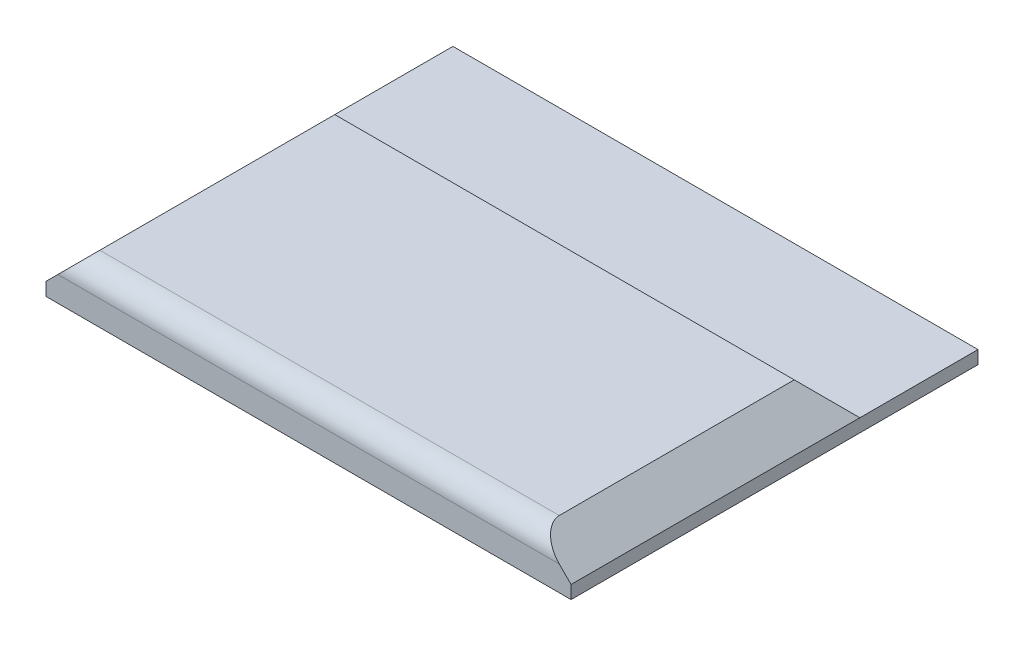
ISO-10303-21;
HEADER;
FILE_DESCRIPTION(('STEP AP214'),'2;1');
FILE_NAME('part.step','',(''),(''),'','','');
FILE_SCHEMA(('AUTOMOTIVE_DESIGN { 1 0 10303 214 1 1 1 1 }'));
ENDSEC;
DATA;
#1=APPLICATION_CONTEXT('core data for automotive mechanical design processes');
#2=APPLICATION_PROTOCOL_DEFINITION('international standard','automotive_design',2000,#1);
#3=PRODUCT_CONTEXT('',#1,'mechanical');
#4=PRODUCT('Part','Part','',(#3));
#5=PRODUCT_RELATED_PRODUCT_CATEGORY('part','',(#4));
#6=PRODUCT_DEFINITION_FORMATION('','',#4);
#7=PRODUCT_DEFINITION_CONTEXT('part definition',#1,'design');
#8=PRODUCT_DEFINITION('design','',#6,#7);
#9=PRODUCT_DEFINITION_SHAPE('','',#8);
#10=(LENGTH_UNIT() NAMED_UNIT(*) SI_UNIT(.MILLI.,.METRE.));
#11=(NAMED_UNIT(*) PLANE_ANGLE_UNIT() SI_UNIT($,.RADIAN.));
#12=(NAMED_UNIT(*) SI_UNIT($,.STERADIAN.) SOLID_ANGLE_UNIT());
#13=UNCERTAINTY_MEASURE_WITH_UNIT(LENGTH_MEASURE(1.E-05),#10,'distance_accuracy_value','');
#14=(GEOMETRIC_REPRESENTATION_CONTEXT(3) GLOBAL_UNCERTAINTY_ASSIGNED_CONTEXT((#13)) GLOBAL_UNIT_ASSIGNED_CONTEXT((#10,
#11,#12)) REPRESENTATION_CONTEXT('',''));
#15=CARTESIAN_POINT('',(0.,0.,0.));
#16=DIRECTION('',(0.,0.,1.));
#17=DIRECTION('',(1.,0.,0.));
#18=AXIS2_PLACEMENT_3D('',#15,#16,#17);
#19=CARTESIAN_POINT('',(63.5,3.96875,-34.925));
#20=DIRECTION('',(0.,1.,0.));
#21=DIRECTION('',(0.,0.,1.));
#22=AXIS2_PLACEMENT_3D('',#19,#20,#21);
#23=PLANE('',#22);
#24=DIRECTION('',(1.,0.,0.));
#25=VECTOR('',#24,1.);
#26=CARTESIAN_POINT('',(63.5,3.96875,-24.209375));
#27=LINE('',#26,#25);
#28=CARTESIAN_POINT('',(16.271875,3.96875,-24.209375));
#29=VERTEX_POINT('',#28);
#30=CARTESIAN_POINT('',(47.228125,3.96875,-24.209375));
#31=VERTEX_POINT('',#30);
#32=EDGE_CURVE('E762',#29,#31,#27,.T.);
#33=ORIENTED_EDGE('',*,*,#32,.F.);
#34=DIRECTION('',(0.,0.,-1.));
#35=VECTOR('',#34,1.);
#36=CARTESIAN_POINT('',(16.271875,3.96875,-34.925));
#37=LINE('',#36,#35);
#38=CARTESIAN_POINT('',(16.271875,3.96875,-30.2986859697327));
#39=VERTEX_POINT('',#38);
#40=EDGE_CURVE('E470',#29,#39,#37,.T.);
#41=ORIENTED_EDGE('',*,*,#40,.T.);
#42=DIRECTION('',(-1.,0.,0.));
#43=VECTOR('',#42,1.);
#44=CARTESIAN_POINT('',(63.5,3.96875,-30.2986859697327));
#45=LINE('',#44,#43);
#46=CARTESIAN_POINT('',(47.228125,3.96875,-30.2986859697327));
#47=VERTEX_POINT('',#46);
#48=EDGE_CURVE('E518',#47,#39,#45,.T.);
#49=ORIENTED_EDGE('',*,*,#48,.F.);
#50=DIRECTION('',(0.,0.,-1.));
#51=VECTOR('',#50,1.);
#52=CARTESIAN_POINT('',(47.228125,3.96875,-34.925));
#53=LINE('',#52,#51);
#54=EDGE_CURVE('E439',#31,#47,#53,.T.);
#55=ORIENTED_EDGE('',*,*,#54,.F.);
#56=EDGE_LOOP('',(#33,#41,#49,#55));
#57=FACE_BOUND('',#56,.T.);
#58=ADVANCED_FACE('F31',(#57),#23,.F.);
#59=DIRECTION('',(1.,0.,0.));
#60=VECTOR('',#59,1.);
#61=CARTESIAN_POINT('',(63.5,3.96875,-24.209375));
#62=LINE('',#61,#60);
#63=CARTESIAN_POINT('',(4.6263140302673,3.96875,-24.209375));
#64=VERTEX_POINT('',#63);
#65=CARTESIAN_POINT('',(15.478125,3.96875,-24.209375));
#66=VERTEX_POINT('',#65);
#67=EDGE_CURVE('E54',#64,#66,#62,.T.);
#68=ORIENTED_EDGE('',*,*,#67,.F.);
#69=DIRECTION('',(0.,0.,1.));
#70=VECTOR('',#69,1.);
#71=CARTESIAN_POINT('',(4.6263140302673,3.96875,-34.925));
#72=LINE('',#71,#70);
#73=CARTESIAN_POINT('',(4.62631403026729,3.96875,-30.2986859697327));
#74=VERTEX_POINT('',#73);
#75=EDGE_CURVE('E526',#74,#64,#72,.T.);
#76=ORIENTED_EDGE('',*,*,#75,.F.);
#77=CARTESIAN_POINT('',(15.478125,3.96875,-30.2986859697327));
#78=VERTEX_POINT('',#77);
#79=EDGE_CURVE('E519',#78,#74,#45,.T.);
#80=ORIENTED_EDGE('',*,*,#79,.F.);
#81=DIRECTION('',(0.,0.,-1.));
#82=VECTOR('',#81,1.);
#83=CARTESIAN_POINT('',(15.478125,3.96875,-34.925));
#84=LINE('',#83,#82);
#85=EDGE_CURVE('E462',#66,#78,#84,.T.);
#86=ORIENTED_EDGE('',*,*,#85,.F.);
#87=EDGE_LOOP('',(#68,#76,#80,#86));
#88=FACE_BOUND('',#87,.T.);
#89=ADVANCED_FACE('F633',(#88),#23,.F.);
#90=CARTESIAN_POINT('',(1.5875,1.5875,0.));
#91=DIRECTION('',(1.,0.,0.));
#92=DIRECTION('',(0.,0.,-1.));
#93=AXIS2_PLACEMENT_3D('',#90,#91,#92);
#94=PLANE('',#93);
#95=DIRECTION('',(0.,0.,-1.));
#96=VECTOR('',#95,1.);
#97=CARTESIAN_POINT('',(1.5875,0.9299359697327,-34.925));
#98=LINE('',#97,#96);
#99=CARTESIAN_POINT('',(1.5875,0.9299359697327,-24.209375));
#100=VERTEX_POINT('',#99);
#101=CARTESIAN_POINT('',(1.5875,0.9299359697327,-33.3375));
#102=VERTEX_POINT('',#101);
#103=EDGE_CURVE('E492',#100,#102,#98,.T.);
#104=ORIENTED_EDGE('',*,*,#103,.F.);
#105=DIRECTION('',(0.,1.,0.));
#106=VECTOR('',#105,1.);
#107=CARTESIAN_POINT('',(1.5875,0.,-24.209375));
#108=LINE('',#107,#106);
#109=CARTESIAN_POINT('',(1.5875,0.,-24.209375));
#110=VERTEX_POINT('',#109);
#111=EDGE_CURVE('E386',#110,#100,#108,.T.);
#112=ORIENTED_EDGE('',*,*,#111,.F.);
#113=DIRECTION('',(0.,0.,1.));
#114=VECTOR('',#113,1.);
#115=CARTESIAN_POINT('',(1.5875,0.,-49.2125));
#116=LINE('',#115,#114);
#117=CARTESIAN_POINT('',(1.5875,0.,-34.2674359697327));
#118=VERTEX_POINT('',#117);
#119=EDGE_CURVE('E374',#118,#110,#116,.T.);
#120=ORIENTED_EDGE('',*,*,#119,.F.);
#121=DIRECTION('',(0.,0.707106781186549,0.707106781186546));
#122=VECTOR('',#121,1.);
#123=CARTESIAN_POINT('',(1.5875,17.9274679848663,-16.3399679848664));
#124=LINE('',#123,#122);
#125=EDGE_CURVE('E490',#118,#102,#124,.T.);
#126=ORIENTED_EDGE('',*,*,#125,.T.);
#127=EDGE_LOOP('',(#104,#112,#120,#126));
#128=FACE_BOUND('',#127,.T.);
#129=ADVANCED_FACE('F799',(#128),#94,.T.);
#130=CARTESIAN_POINT('',(61.9125,1.5875,0.));
#131=DIRECTION('',(-1.,0.,0.));
#132=DIRECTION('',(0.,0.,1.));
#133=AXIS2_PLACEMENT_3D('',#130,#131,#132);
#134=PLANE('',#133);
#135=DIRECTION('',(0.,0.,-1.));
#136=VECTOR('',#135,1.);
#137=CARTESIAN_POINT('',(61.9125,0.,-49.2125));
#138=LINE('',#137,#136);
#139=CARTESIAN_POINT('',(61.9125,0.,-24.209375));
#140=VERTEX_POINT('',#139);
#141=CARTESIAN_POINT('',(61.9125,0.,-34.2674359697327));
#142=VERTEX_POINT('',#141);
#143=EDGE_CURVE('E541',#140,#142,#138,.T.);
#144=ORIENTED_EDGE('',*,*,#143,.F.);
#145=DIRECTION('',(0.,1.,0.));
#146=VECTOR('',#145,1.);
#147=CARTESIAN_POINT('',(61.9125,0.,-24.209375));
#148=LINE('',#147,#146);
#149=CARTESIAN_POINT('',(61.9125,0.929935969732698,-24.209375));
#150=VERTEX_POINT('',#149);
#151=EDGE_CURVE('E391',#140,#150,#148,.T.);
#152=ORIENTED_EDGE('',*,*,#151,.T.);
#153=DIRECTION('',(0.,0.,1.));
#154=VECTOR('',#153,1.);
#155=CARTESIAN_POINT('',(61.9125,0.929935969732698,-34.925));
#156=LINE('',#155,#154);
#157=CARTESIAN_POINT('',(61.9125,0.929935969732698,-33.3375));
#158=VERTEX_POINT('',#157);
#159=EDGE_CURVE('E506',#158,#150,#156,.T.);
#160=ORIENTED_EDGE('',*,*,#159,.F.);
#161=DIRECTION('',(0.,0.707106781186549,0.707106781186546));
#162=VECTOR('',#161,1.);
#163=CARTESIAN_POINT('',(61.9125,4.43371798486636,-29.8337179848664));
#164=LINE('',#163,#162);
#165=EDGE_CURVE('E531',#142,#158,#164,.T.);
#166=ORIENTED_EDGE('',*,*,#165,.F.);
#167=EDGE_LOOP('',(#144,#152,#160,#166));
#168=FACE_BOUND('',#167,.T.);
#169=ADVANCED_FACE('F815',(#168),#134,.T.);
#170=DIRECTION('',(1.,0.,0.));
#171=VECTOR('',#170,1.);
#172=CARTESIAN_POINT('',(63.5,3.96875,-24.209375));
#173=LINE('',#172,#171);
#174=CARTESIAN_POINT('',(48.021875,3.96875,-24.209375));
#175=VERTEX_POINT('',#174);
#176=CARTESIAN_POINT('',(58.8736859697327,3.96875,-24.209375));
#177=VERTEX_POINT('',#176);
#178=EDGE_CURVE('E756',#175,#177,#173,.T.);
#179=ORIENTED_EDGE('',*,*,#178,.F.);
#180=DIRECTION('',(0.,0.,-1.));
#181=VECTOR('',#180,1.);
#182=CARTESIAN_POINT('',(48.021875,3.96875,-34.925));
#183=LINE('',#182,#181);
#184=CARTESIAN_POINT('',(48.021875,3.96875,-30.2986859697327));
#185=VERTEX_POINT('',#184);
#186=EDGE_CURVE('E448',#175,#185,#183,.T.);
#187=ORIENTED_EDGE('',*,*,#186,.T.);
#188=CARTESIAN_POINT('',(58.8736859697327,3.96875,-30.2986859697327));
#189=VERTEX_POINT('',#188);
#190=EDGE_CURVE('E514',#189,#185,#45,.T.);
#191=ORIENTED_EDGE('',*,*,#190,.F.);
#192=DIRECTION('',(0.,0.,-1.));
#193=VECTOR('',#192,1.);
#194=CARTESIAN_POINT('',(58.8736859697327,3.96875,-34.925));
#195=LINE('',#194,#193);
#196=EDGE_CURVE('E517',#177,#189,#195,.T.);
#197=ORIENTED_EDGE('',*,*,#196,.F.);
#198=EDGE_LOOP('',(#179,#187,#191,#197));
#199=FACE_BOUND('',#198,.T.);
#200=ADVANCED_FACE('F800',(#199),#23,.F.);
#201=CARTESIAN_POINT('',(5.09128201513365,4.43371798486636,-34.925));
#202=DIRECTION('',(-0.707106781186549,0.707106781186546,0.));
#203=DIRECTION('',(-0.707106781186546,-0.707106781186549,0.));
#204=AXIS2_PLACEMENT_3D('',#201,#202,#203);
#205=PLANE('',#204);
#206=DIRECTION('',(0.707106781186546,0.707106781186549,0.));
#207=VECTOR('',#206,1.);
#208=CARTESIAN_POINT('',(5.09128201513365,4.43371798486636,-24.209375));
#209=LINE('',#208,#207);
#210=EDGE_CURVE('E637',#100,#64,#209,.T.);
#211=ORIENTED_EDGE('',*,*,#210,.F.);
#212=ORIENTED_EDGE('',*,*,#103,.T.);
#213=DIRECTION('',(0.577350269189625,0.577350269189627,0.577350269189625));
#214=VECTOR('',#213,1.);
#215=CARTESIAN_POINT('',(24.5608546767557,23.9032906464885,-10.3641453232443));
#216=LINE('',#215,#214);
#217=EDGE_CURVE('E511',#102,#74,#216,.T.);
#218=ORIENTED_EDGE('',*,*,#217,.T.);
#219=ORIENTED_EDGE('',*,*,#75,.T.);
#220=EDGE_LOOP('',(#211,#212,#218,#219));
#221=FACE_BOUND('',#220,.T.);
#222=ADVANCED_FACE('F635',(#221),#205,.F.);
#223=CARTESIAN_POINT('',(58.4087179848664,4.43371798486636,-34.925));
#224=DIRECTION('',(0.707106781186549,0.707106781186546,0.));
#225=DIRECTION('',(-0.707106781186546,0.707106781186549,0.));
#226=AXIS2_PLACEMENT_3D('',#223,#224,#225);
#227=PLANE('',#226);
#228=DIRECTION('',(0.707106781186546,-0.707106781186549,0.));
#229=VECTOR('',#228,1.);
#230=CARTESIAN_POINT('',(58.4087179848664,4.43371798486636,-24.209375));
#231=LINE('',#230,#229);
#232=EDGE_CURVE('E368',#177,#150,#231,.T.);
#233=ORIENTED_EDGE('',*,*,#232,.F.);
#234=ORIENTED_EDGE('',*,*,#196,.T.);
#235=DIRECTION('',(-0.577350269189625,0.577350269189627,0.577350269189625));
#236=VECTOR('',#235,1.);
#237=CARTESIAN_POINT('',(60.1058119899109,2.73662397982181,-31.5308119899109));
#238=LINE('',#237,#236);
#239=EDGE_CURVE('E474',#158,#189,#238,.T.);
#240=ORIENTED_EDGE('',*,*,#239,.F.);
#241=ORIENTED_EDGE('',*,*,#159,.T.);
#242=EDGE_LOOP('',(#233,#234,#240,#241));
#243=FACE_BOUND('',#242,.T.);
#244=ADVANCED_FACE('F788',(#243),#227,.F.);
#245=CARTESIAN_POINT('',(16.271875,0.,-1.5875));
#246=DIRECTION('',(1.,0.,0.));
#247=DIRECTION('',(0.,0.,-1.));
#248=AXIS2_PLACEMENT_3D('',#245,#246,#247);
#249=PLANE('',#248);
#250=ORIENTED_EDGE('',*,*,#40,.F.);
#251=DIRECTION('',(0.,-1.,0.));
#252=VECTOR('',#251,1.);
#253=CARTESIAN_POINT('',(16.271875,0.,-24.209375));
#254=LINE('',#253,#252);
#255=CARTESIAN_POINT('',(16.271875,0.,-24.209375));
#256=VERTEX_POINT('',#255);
#257=EDGE_CURVE('E760',#29,#256,#254,.T.);
#258=ORIENTED_EDGE('',*,*,#257,.T.);
#259=DIRECTION('',(0.,0.,-1.));
#260=VECTOR('',#259,1.);
#261=CARTESIAN_POINT('',(16.271875,0.,-1.5875));
#262=LINE('',#261,#260);
#263=CARTESIAN_POINT('',(16.271875,0.,-34.2674359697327));
#264=VERTEX_POINT('',#263);
#265=EDGE_CURVE('E455',#256,#264,#262,.T.);
#266=ORIENTED_EDGE('',*,*,#265,.T.);
#267=DIRECTION('',(0.,-0.707106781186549,-0.707106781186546));
#268=VECTOR('',#267,1.);
#269=CARTESIAN_POINT('',(16.271875,4.43371798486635,-29.8337179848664));
#270=LINE('',#269,#268);
#271=EDGE_CURVE('E466',#39,#264,#270,.T.);
#272=ORIENTED_EDGE('',*,*,#271,.F.);
#273=EDGE_LOOP('',(#250,#258,#266,#272));
#274=FACE_BOUND('',#273,.T.);
#275=ADVANCED_FACE('F777',(#274),#249,.T.);
#276=CARTESIAN_POINT('',(15.478125,0.,-1.5875));
#277=DIRECTION('',(1.,0.,0.));
#278=DIRECTION('',(0.,0.,-1.));
#279=AXIS2_PLACEMENT_3D('',#276,#277,#278);
#280=PLANE('',#279);
#281=DIRECTION('',(0.,-1.,0.));
#282=VECTOR('',#281,1.);
#283=CARTESIAN_POINT('',(15.478125,0.,-24.209375));
#284=LINE('',#283,#282);
#285=CARTESIAN_POINT('',(15.478125,0.,-24.209375));
#286=VERTEX_POINT('',#285);
#287=EDGE_CURVE('E352',#66,#286,#284,.T.);
#288=ORIENTED_EDGE('',*,*,#287,.F.);
#289=ORIENTED_EDGE('',*,*,#85,.T.);
#290=DIRECTION('',(0.,-0.707106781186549,-0.707106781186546));
#291=VECTOR('',#290,1.);
#292=CARTESIAN_POINT('',(15.478125,4.43371798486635,-29.8337179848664));
#293=LINE('',#292,#291);
#294=CARTESIAN_POINT('',(15.478125,0.,-34.2674359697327));
#295=VERTEX_POINT('',#294);
#296=EDGE_CURVE('E354',#78,#295,#293,.T.);
#297=ORIENTED_EDGE('',*,*,#296,.T.);
#298=DIRECTION('',(0.,0.,-1.));
#299=VECTOR('',#298,1.);
#300=CARTESIAN_POINT('',(15.478125,0.,-1.5875));
#301=LINE('',#300,#299);
#302=EDGE_CURVE('E349',#286,#295,#301,.T.);
#303=ORIENTED_EDGE('',*,*,#302,.F.);
#304=EDGE_LOOP('',(#288,#289,#297,#303));
#305=FACE_BOUND('',#304,.T.);
#306=ADVANCED_FACE('F351',(#305),#280,.F.);
#307=CARTESIAN_POINT('',(48.021875,0.,-1.5875));
#308=DIRECTION('',(1.,0.,0.));
#309=DIRECTION('',(0.,0.,-1.));
#310=AXIS2_PLACEMENT_3D('',#307,#308,#309);
#311=PLANE('',#310);
#312=ORIENTED_EDGE('',*,*,#186,.F.);
#313=DIRECTION('',(0.,-1.,0.));
#314=VECTOR('',#313,1.);
#315=CARTESIAN_POINT('',(48.021875,0.,-24.209375));
#316=LINE('',#315,#314);
#317=CARTESIAN_POINT('',(48.021875,0.,-24.209375));
#318=VERTEX_POINT('',#317);
#319=EDGE_CURVE('E720',#175,#318,#316,.T.);
#320=ORIENTED_EDGE('',*,*,#319,.T.);
#321=DIRECTION('',(0.,0.,-1.));
#322=VECTOR('',#321,1.);
#323=CARTESIAN_POINT('',(48.021875,0.,-1.5875));
#324=LINE('',#323,#322);
#325=CARTESIAN_POINT('',(48.021875,0.,-34.2674359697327));
#326=VERTEX_POINT('',#325);
#327=EDGE_CURVE('E710',#318,#326,#324,.T.);
#328=ORIENTED_EDGE('',*,*,#327,.T.);
#329=DIRECTION('',(0.,-0.707106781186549,-0.707106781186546));
#330=VECTOR('',#329,1.);
#331=CARTESIAN_POINT('',(48.021875,4.43371798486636,-29.8337179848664));
#332=LINE('',#331,#330);
#333=EDGE_CURVE('E444',#185,#326,#332,.T.);
#334=ORIENTED_EDGE('',*,*,#333,.F.);
#335=EDGE_LOOP('',(#312,#320,#328,#334));
#336=FACE_BOUND('',#335,.T.);
#337=ADVANCED_FACE('F718',(#336),#311,.T.);
#338=CARTESIAN_POINT('',(47.228125,0.,-1.5875));
#339=DIRECTION('',(1.,0.,0.));
#340=DIRECTION('',(0.,0.,-1.));
#341=AXIS2_PLACEMENT_3D('',#338,#339,#340);
#342=PLANE('',#341);
#343=DIRECTION('',(0.,-1.,0.));
#344=VECTOR('',#343,1.);
#345=CARTESIAN_POINT('',(47.228125,0.,-24.209375));
#346=LINE('',#345,#344);
#347=CARTESIAN_POINT('',(47.228125,0.,-24.209375));
#348=VERTEX_POINT('',#347);
#349=EDGE_CURVE('E396',#31,#348,#346,.T.);
#350=ORIENTED_EDGE('',*,*,#349,.F.);
#351=ORIENTED_EDGE('',*,*,#54,.T.);
#352=DIRECTION('',(0.,-0.707106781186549,-0.707106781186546));
#353=VECTOR('',#352,1.);
#354=CARTESIAN_POINT('',(47.228125,4.43371798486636,-29.8337179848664));
#355=LINE('',#354,#353);
#356=CARTESIAN_POINT('',(47.228125,0.,-34.2674359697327));
#357=VERTEX_POINT('',#356);
#358=EDGE_CURVE('E436',#47,#357,#355,.T.);
#359=ORIENTED_EDGE('',*,*,#358,.T.);
#360=DIRECTION('',(0.,0.,-1.));
#361=VECTOR('',#360,1.);
#362=CARTESIAN_POINT('',(47.228125,0.,-1.5875));
#363=LINE('',#362,#361);
#364=EDGE_CURVE('E428',#348,#357,#363,.T.);
#365=ORIENTED_EDGE('',*,*,#364,.F.);
#366=EDGE_LOOP('',(#350,#351,#359,#365));
#367=FACE_BOUND('',#366,.T.);
#368=ADVANCED_FACE('F616',(#367),#342,.F.);
#369=CARTESIAN_POINT('',(16.271875,3.96875,-11.509375));
#370=VERTEX_POINT('',#369);
#371=CARTESIAN_POINT('',(16.271875,3.96875,-23.415625));
#372=VERTEX_POINT('',#371);
#373=EDGE_CURVE('E475',#370,#372,#37,.T.);
#374=ORIENTED_EDGE('',*,*,#373,.T.);
#375=DIRECTION('',(1.,0.,0.));
#376=VECTOR('',#375,1.);
#377=CARTESIAN_POINT('',(63.5,3.96875,-23.415625));
#378=LINE('',#377,#376);
#379=CARTESIAN_POINT('',(47.228125,3.96875,-23.415625));
#380=VERTEX_POINT('',#379);
#381=EDGE_CURVE('E612',#372,#380,#378,.T.);
#382=ORIENTED_EDGE('',*,*,#381,.T.);
#383=CARTESIAN_POINT('',(47.228125,3.96875,-11.509375));
#384=VERTEX_POINT('',#383);
#385=EDGE_CURVE('E445',#384,#380,#53,.T.);
#386=ORIENTED_EDGE('',*,*,#385,.F.);
#387=DIRECTION('',(1.,0.,0.));
#388=VECTOR('',#387,1.);
#389=CARTESIAN_POINT('',(63.5,3.96875,-11.509375));
#390=LINE('',#389,#388);
#391=EDGE_CURVE('E604',#370,#384,#390,.T.);
#392=ORIENTED_EDGE('',*,*,#391,.F.);
#393=EDGE_LOOP('',(#374,#382,#386,#392));
#394=FACE_BOUND('',#393,.T.);
#395=ADVANCED_FACE('F610',(#394),#23,.F.);
#396=CARTESIAN_POINT('',(4.6263140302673,3.96875,-23.415625));
#397=VERTEX_POINT('',#396);
#398=CARTESIAN_POINT('',(4.6263140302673,3.96875,-11.509375));
#399=VERTEX_POINT('',#398);
#400=EDGE_CURVE('E528',#397,#399,#72,.T.);
#401=ORIENTED_EDGE('',*,*,#400,.F.);
#402=DIRECTION('',(1.,0.,0.));
#403=VECTOR('',#402,1.);
#404=CARTESIAN_POINT('',(63.5,3.96875,-23.415625));
#405=LINE('',#404,#403);
#406=CARTESIAN_POINT('',(15.478125,3.96875,-23.415625));
#407=VERTEX_POINT('',#406);
#408=EDGE_CURVE('E648',#397,#407,#405,.T.);
#409=ORIENTED_EDGE('',*,*,#408,.T.);
#410=CARTESIAN_POINT('',(15.478125,3.96875,-11.509375));
#411=VERTEX_POINT('',#410);
#412=EDGE_CURVE('E467',#411,#407,#84,.T.);
#413=ORIENTED_EDGE('',*,*,#412,.F.);
#414=DIRECTION('',(1.,0.,0.));
#415=VECTOR('',#414,1.);
#416=CARTESIAN_POINT('',(63.5,3.96875,-11.509375));
#417=LINE('',#416,#415);
#418=EDGE_CURVE('E687',#399,#411,#417,.T.);
#419=ORIENTED_EDGE('',*,*,#418,.F.);
#420=EDGE_LOOP('',(#401,#409,#413,#419));
#421=FACE_BOUND('',#420,.T.);
#422=ADVANCED_FACE('F839',(#421),#23,.F.);
#423=DIRECTION('',(0.,1.,0.));
#424=VECTOR('',#423,1.);
#425=CARTESIAN_POINT('',(1.5875,0.,-23.415625));
#426=LINE('',#425,#424);
#427=CARTESIAN_POINT('',(1.5875,0.,-23.415625));
#428=VERTEX_POINT('',#427);
#429=CARTESIAN_POINT('',(1.5875,0.9299359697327,-23.415625));
#430=VERTEX_POINT('',#429);
#431=EDGE_CURVE('E380',#428,#430,#426,.T.);
#432=ORIENTED_EDGE('',*,*,#431,.T.);
#433=CARTESIAN_POINT('',(1.5875,0.9299359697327,-11.509375));
#434=VERTEX_POINT('',#433);
#435=EDGE_CURVE('E491',#434,#430,#98,.T.);
#436=ORIENTED_EDGE('',*,*,#435,.F.);
#437=DIRECTION('',(0.,1.,0.));
#438=VECTOR('',#437,1.);
#439=CARTESIAN_POINT('',(1.58749999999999,0.,-11.509375));
#440=LINE('',#439,#438);
#441=CARTESIAN_POINT('',(1.5875,0.,-11.509375));
#442=VERTEX_POINT('',#441);
#443=EDGE_CURVE('E652',#442,#434,#440,.T.);
#444=ORIENTED_EDGE('',*,*,#443,.F.);
#445=EDGE_CURVE('E537',#428,#442,#116,.T.);
#446=ORIENTED_EDGE('',*,*,#445,.F.);
#447=EDGE_LOOP('',(#432,#436,#444,#446));
#448=FACE_BOUND('',#447,.T.);
#449=ADVANCED_FACE('F844',(#448),#94,.T.);
#450=DIRECTION('',(0.,1.,0.));
#451=VECTOR('',#450,1.);
#452=CARTESIAN_POINT('',(61.9125,0.,-23.415625));
#453=LINE('',#452,#451);
#454=CARTESIAN_POINT('',(61.9125,0.,-23.415625));
#455=VERTEX_POINT('',#454);
#456=CARTESIAN_POINT('',(61.9125,0.929935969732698,-23.415625));
#457=VERTEX_POINT('',#456);
#458=EDGE_CURVE('E375',#455,#457,#453,.T.);
#459=ORIENTED_EDGE('',*,*,#458,.F.);
#460=CARTESIAN_POINT('',(61.9125,0.,-11.509375));
#461=VERTEX_POINT('',#460);
#462=EDGE_CURVE('E540',#461,#455,#138,.T.);
#463=ORIENTED_EDGE('',*,*,#462,.F.);
#464=DIRECTION('',(0.,1.,0.));
#465=VECTOR('',#464,1.);
#466=CARTESIAN_POINT('',(61.9125,0.,-11.509375));
#467=LINE('',#466,#465);
#468=CARTESIAN_POINT('',(61.9125,0.929935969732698,-11.509375));
#469=VERTEX_POINT('',#468);
#470=EDGE_CURVE('E649',#461,#469,#467,.T.);
#471=ORIENTED_EDGE('',*,*,#470,.T.);
#472=EDGE_CURVE('E509',#457,#469,#156,.T.);
#473=ORIENTED_EDGE('',*,*,#472,.F.);
#474=EDGE_LOOP('',(#459,#463,#471,#473));
#475=FACE_BOUND('',#474,.T.);
#476=ADVANCED_FACE('F735',(#475),#134,.T.);
#477=CARTESIAN_POINT('',(48.021875,3.96875,-11.509375));
#478=VERTEX_POINT('',#477);
#479=CARTESIAN_POINT('',(48.021875,3.96875,-23.415625));
#480=VERTEX_POINT('',#479);
#481=EDGE_CURVE('E452',#478,#480,#183,.T.);
#482=ORIENTED_EDGE('',*,*,#481,.T.);
#483=DIRECTION('',(1.,0.,0.));
#484=VECTOR('',#483,1.);
#485=CARTESIAN_POINT('',(63.5,3.96875,-23.415625));
#486=LINE('',#485,#484);
#487=CARTESIAN_POINT('',(58.8736859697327,3.96875,-23.415625));
#488=VERTEX_POINT('',#487);
#489=EDGE_CURVE('E741',#480,#488,#486,.T.);
#490=ORIENTED_EDGE('',*,*,#489,.T.);
#491=CARTESIAN_POINT('',(58.8736859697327,3.96875,-11.509375));
#492=VERTEX_POINT('',#491);
#493=EDGE_CURVE('E525',#492,#488,#195,.T.);
#494=ORIENTED_EDGE('',*,*,#493,.F.);
#495=DIRECTION('',(1.,0.,0.));
#496=VECTOR('',#495,1.);
#497=CARTESIAN_POINT('',(63.5,3.96875,-11.509375));
#498=LINE('',#497,#496);
#499=EDGE_CURVE('E678',#478,#492,#498,.T.);
#500=ORIENTED_EDGE('',*,*,#499,.F.);
#501=EDGE_LOOP('',(#482,#490,#494,#500));
#502=FACE_BOUND('',#501,.T.);
#503=ADVANCED_FACE('F831',(#502),#23,.F.);
#504=ORIENTED_EDGE('',*,*,#435,.T.);
#505=DIRECTION('',(0.707106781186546,0.707106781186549,0.));
#506=VECTOR('',#505,1.);
#507=CARTESIAN_POINT('',(5.09128201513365,4.43371798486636,-23.415625));
#508=LINE('',#507,#506);
#509=EDGE_CURVE('E46',#430,#397,#508,.T.);
#510=ORIENTED_EDGE('',*,*,#509,.T.);
#511=ORIENTED_EDGE('',*,*,#400,.T.);
#512=DIRECTION('',(0.707106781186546,0.707106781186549,0.));
#513=VECTOR('',#512,1.);
#514=CARTESIAN_POINT('',(5.09128201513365,4.43371798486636,-11.509375));
#515=LINE('',#514,#513);
#516=EDGE_CURVE('E641',#434,#399,#515,.T.);
#517=ORIENTED_EDGE('',*,*,#516,.F.);
#518=EDGE_LOOP('',(#504,#510,#511,#517));
#519=FACE_BOUND('',#518,.T.);
#520=ADVANCED_FACE('F639',(#519),#205,.F.);
#521=ORIENTED_EDGE('',*,*,#493,.T.);
#522=DIRECTION('',(0.707106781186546,-0.707106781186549,0.));
#523=VECTOR('',#522,1.);
#524=CARTESIAN_POINT('',(58.4087179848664,4.43371798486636,-23.415625));
#525=LINE('',#524,#523);
#526=EDGE_CURVE('E740',#488,#457,#525,.T.);
#527=ORIENTED_EDGE('',*,*,#526,.T.);
#528=ORIENTED_EDGE('',*,*,#472,.T.);
#529=DIRECTION('',(0.707106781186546,-0.707106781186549,0.));
#530=VECTOR('',#529,1.);
#531=CARTESIAN_POINT('',(58.4087179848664,4.43371798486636,-11.509375));
#532=LINE('',#531,#530);
#533=EDGE_CURVE('E681',#492,#469,#532,.T.);
#534=ORIENTED_EDGE('',*,*,#533,.F.);
#535=EDGE_LOOP('',(#521,#527,#528,#534));
#536=FACE_BOUND('',#535,.T.);
#537=ADVANCED_FACE('F774',(#536),#227,.F.);
#538=DIRECTION('',(0.,-1.,0.));
#539=VECTOR('',#538,1.);
#540=CARTESIAN_POINT('',(16.271875,0.,-23.415625));
#541=LINE('',#540,#539);
#542=CARTESIAN_POINT('',(16.271875,0.,-23.415625));
#543=VERTEX_POINT('',#542);
#544=EDGE_CURVE('E415',#372,#543,#541,.T.);
#545=ORIENTED_EDGE('',*,*,#544,.F.);
#546=ORIENTED_EDGE('',*,*,#373,.F.);
#547=DIRECTION('',(0.,-1.,0.));
#548=VECTOR('',#547,1.);
#549=CARTESIAN_POINT('',(16.271875,0.,-11.509375));
#550=LINE('',#549,#548);
#551=CARTESIAN_POINT('',(16.271875,0.,-11.509375));
#552=VERTEX_POINT('',#551);
#553=EDGE_CURVE('E674',#370,#552,#550,.T.);
#554=ORIENTED_EDGE('',*,*,#553,.T.);
#555=EDGE_CURVE('E421',#552,#543,#262,.T.);
#556=ORIENTED_EDGE('',*,*,#555,.T.);
#557=EDGE_LOOP('',(#545,#546,#554,#556));
#558=FACE_BOUND('',#557,.T.);
#559=ADVANCED_FACE('F771',(#558),#249,.T.);
#560=ORIENTED_EDGE('',*,*,#412,.T.);
#561=DIRECTION('',(0.,-1.,0.));
#562=VECTOR('',#561,1.);
#563=CARTESIAN_POINT('',(15.478125,0.,-23.415625));
#564=LINE('',#563,#562);
#565=CARTESIAN_POINT('',(15.478125,0.,-23.415625));
#566=VERTEX_POINT('',#565);
#567=EDGE_CURVE('E654',#407,#566,#564,.T.);
#568=ORIENTED_EDGE('',*,*,#567,.T.);
#569=CARTESIAN_POINT('',(15.478125,0.,-11.509375));
#570=VERTEX_POINT('',#569);
#571=EDGE_CURVE('E358',#570,#566,#301,.T.);
#572=ORIENTED_EDGE('',*,*,#571,.F.);
#573=DIRECTION('',(0.,-1.,0.));
#574=VECTOR('',#573,1.);
#575=CARTESIAN_POINT('',(15.478125,0.,-11.509375));
#576=LINE('',#575,#574);
#577=EDGE_CURVE('E684',#411,#570,#576,.T.);
#578=ORIENTED_EDGE('',*,*,#577,.F.);
#579=EDGE_LOOP('',(#560,#568,#572,#578));
#580=FACE_BOUND('',#579,.T.);
#581=ADVANCED_FACE('F773',(#580),#280,.F.);
#582=DIRECTION('',(0.,-1.,0.));
#583=VECTOR('',#582,1.);
#584=CARTESIAN_POINT('',(48.021875,0.,-23.415625));
#585=LINE('',#584,#583);
#586=CARTESIAN_POINT('',(48.021875,0.,-23.415625));
#587=VERTEX_POINT('',#586);
#588=EDGE_CURVE('E745',#480,#587,#585,.T.);
#589=ORIENTED_EDGE('',*,*,#588,.F.);
#590=ORIENTED_EDGE('',*,*,#481,.F.);
#591=DIRECTION('',(0.,-1.,0.));
#592=VECTOR('',#591,1.);
#593=CARTESIAN_POINT('',(48.021875,0.,-11.509375));
#594=LINE('',#593,#592);
#595=CARTESIAN_POINT('',(48.021875,0.,-11.509375));
#596=VERTEX_POINT('',#595);
#597=EDGE_CURVE('E676',#478,#596,#594,.T.);
#598=ORIENTED_EDGE('',*,*,#597,.T.);
#599=EDGE_CURVE('E711',#596,#587,#324,.T.);
#600=ORIENTED_EDGE('',*,*,#599,.T.);
#601=EDGE_LOOP('',(#589,#590,#598,#600));
#602=FACE_BOUND('',#601,.T.);
#603=ADVANCED_FACE('F782',(#602),#311,.T.);
#604=ORIENTED_EDGE('',*,*,#385,.T.);
#605=DIRECTION('',(0.,-1.,0.));
#606=VECTOR('',#605,1.);
#607=CARTESIAN_POINT('',(47.228125,0.,-23.415625));
#608=LINE('',#607,#606);
#609=CARTESIAN_POINT('',(47.228125,0.,-23.415625));
#610=VERTEX_POINT('',#609);
#611=EDGE_CURVE('E414',#380,#610,#608,.T.);
#612=ORIENTED_EDGE('',*,*,#611,.T.);
#613=CARTESIAN_POINT('',(47.228125,0.,-11.509375));
#614=VERTEX_POINT('',#613);
#615=EDGE_CURVE('E423',#614,#610,#363,.T.);
#616=ORIENTED_EDGE('',*,*,#615,.F.);
#617=DIRECTION('',(0.,-1.,0.));
#618=VECTOR('',#617,1.);
#619=CARTESIAN_POINT('',(47.228125,0.,-11.509375));
#620=LINE('',#619,#618);
#621=EDGE_CURVE('E35',#384,#614,#620,.T.);
#622=ORIENTED_EDGE('',*,*,#621,.F.);
#623=EDGE_LOOP('',(#604,#612,#616,#622));
#624=FACE_BOUND('',#623,.T.);
#625=ADVANCED_FACE('F607',(#624),#342,.F.);
#626=CARTESIAN_POINT('',(0.,1.5875,-1.5875));
#627=DIRECTION('',(0.,0.,-1.));
#628=DIRECTION('',(-1.,0.,0.));
#629=AXIS2_PLACEMENT_3D('',#626,#627,#628);
#630=PLANE('',#629);
#631=DIRECTION('',(1.,0.,0.));
#632=VECTOR('',#631,1.);
#633=CARTESIAN_POINT('',(0.,3.96875,-1.5875));
#634=LINE('',#633,#632);
#635=CARTESIAN_POINT('',(16.271875,3.96875,-1.5875));
#636=VERTEX_POINT('',#635);
#637=CARTESIAN_POINT('',(47.228125,3.96875,-1.5875));
#638=VERTEX_POINT('',#637);
#639=EDGE_CURVE('E504',#636,#638,#634,.T.);
#640=ORIENTED_EDGE('',*,*,#639,.T.);
#641=DIRECTION('',(0.,1.,0.));
#642=VECTOR('',#641,1.);
#643=CARTESIAN_POINT('',(47.228125,0.,-1.5875));
#644=LINE('',#643,#642);
#645=CARTESIAN_POINT('',(47.228125,0.,-1.5875));
#646=VERTEX_POINT('',#645);
#647=EDGE_CURVE('E432',#646,#638,#644,.T.);
#648=ORIENTED_EDGE('',*,*,#647,.F.);
#649=DIRECTION('',(1.,0.,0.));
#650=VECTOR('',#649,1.);
#651=CARTESIAN_POINT('',(0.,0.,-1.5875));
#652=LINE('',#651,#650);
#653=CARTESIAN_POINT('',(16.271875,0.,-1.5875));
#654=VERTEX_POINT('',#653);
#655=EDGE_CURVE('E545',#654,#646,#652,.T.);
#656=ORIENTED_EDGE('',*,*,#655,.F.);
#657=DIRECTION('',(0.,1.,0.));
#658=VECTOR('',#657,1.);
#659=CARTESIAN_POINT('',(16.271875,0.,-1.5875));
#660=LINE('',#659,#658);
#661=EDGE_CURVE('E453',#654,#636,#660,.T.);
#662=ORIENTED_EDGE('',*,*,#661,.T.);
#663=EDGE_LOOP('',(#640,#648,#656,#662));
#664=FACE_BOUND('',#663,.T.);
#665=ADVANCED_FACE('F827',(#664),#630,.T.);
#666=CARTESIAN_POINT('',(16.271875,3.96875,-10.715625));
#667=VERTEX_POINT('',#666);
#668=EDGE_CURVE('E471',#636,#667,#37,.T.);
#669=ORIENTED_EDGE('',*,*,#668,.T.);
#670=DIRECTION('',(1.,0.,0.));
#671=VECTOR('',#670,1.);
#672=CARTESIAN_POINT('',(63.5,3.96875,-10.715625));
#673=LINE('',#672,#671);
#674=CARTESIAN_POINT('',(47.228125,3.96875,-10.715625));
#675=VERTEX_POINT('',#674);
#676=EDGE_CURVE('E691',#667,#675,#673,.T.);
#677=ORIENTED_EDGE('',*,*,#676,.T.);
#678=EDGE_CURVE('E441',#638,#675,#53,.T.);
#679=ORIENTED_EDGE('',*,*,#678,.F.);
#680=ORIENTED_EDGE('',*,*,#639,.F.);
#681=EDGE_LOOP('',(#669,#677,#679,#680));
#682=FACE_BOUND('',#681,.T.);
#683=ADVANCED_FACE('F819',(#682),#23,.F.);
#684=CARTESIAN_POINT('',(63.5,4.43371798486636,-29.8337179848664));
#685=DIRECTION('',(0.,0.707106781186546,-0.707106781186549));
#686=DIRECTION('',(0.,0.707106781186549,0.707106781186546));
#687=AXIS2_PLACEMENT_3D('',#684,#685,#686);
#688=PLANE('',#687);
#689=ORIENTED_EDGE('',*,*,#358,.F.);
#690=ORIENTED_EDGE('',*,*,#48,.T.);
#691=ORIENTED_EDGE('',*,*,#271,.T.);
#692=DIRECTION('',(-1.,0.,0.));
#693=VECTOR('',#692,1.);
#694=CARTESIAN_POINT('',(63.5,0.,-34.2674359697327));
#695=LINE('',#694,#693);
#696=EDGE_CURVE('E480',#357,#264,#695,.T.);
#697=ORIENTED_EDGE('',*,*,#696,.F.);
#698=EDGE_LOOP('',(#689,#690,#691,#697));
#699=FACE_BOUND('',#698,.T.);
#700=ADVANCED_FACE('F624',(#699),#688,.F.);
#701=CARTESIAN_POINT('',(4.62631403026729,3.96875,-1.5875));
#702=VERTEX_POINT('',#701);
#703=CARTESIAN_POINT('',(15.478125,3.96875,-1.5875));
#704=VERTEX_POINT('',#703);
#705=EDGE_CURVE('E500',#702,#704,#634,.T.);
#706=ORIENTED_EDGE('',*,*,#705,.T.);
#707=DIRECTION('',(0.,1.,0.));
#708=VECTOR('',#707,1.);
#709=CARTESIAN_POINT('',(15.478125,0.,-1.5875));
#710=LINE('',#709,#708);
#711=CARTESIAN_POINT('',(15.478125,0.,-1.5875));
#712=VERTEX_POINT('',#711);
#713=EDGE_CURVE('E359',#712,#704,#710,.T.);
#714=ORIENTED_EDGE('',*,*,#713,.F.);
#715=CARTESIAN_POINT('',(1.5875,0.,-1.5875));
#716=VERTEX_POINT('',#715);
#717=EDGE_CURVE('E542',#716,#712,#652,.T.);
#718=ORIENTED_EDGE('',*,*,#717,.F.);
#719=DIRECTION('',(0.,-1.,0.));
#720=VECTOR('',#719,1.);
#721=CARTESIAN_POINT('',(1.5875,1.5875,-1.5875));
#722=LINE('',#721,#720);
#723=CARTESIAN_POINT('',(1.5875,0.9299359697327,-1.5875));
#724=VERTEX_POINT('',#723);
#725=EDGE_CURVE('E482',#724,#716,#722,.T.);
#726=ORIENTED_EDGE('',*,*,#725,.F.);
#727=DIRECTION('',(-0.707106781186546,-0.707106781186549,0.));
#728=VECTOR('',#727,1.);
#729=CARTESIAN_POINT('',(5.09128201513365,4.43371798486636,-1.5875));
#730=LINE('',#729,#728);
#731=EDGE_CURVE('E499',#702,#724,#730,.T.);
#732=ORIENTED_EDGE('',*,*,#731,.F.);
#733=EDGE_LOOP('',(#706,#714,#718,#726,#732));
#734=FACE_BOUND('',#733,.T.);
#735=ADVANCED_FACE('F817',(#734),#630,.T.);
#736=CARTESIAN_POINT('',(4.6263140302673,3.96875,-10.715625));
#737=VERTEX_POINT('',#736);
#738=EDGE_CURVE('E485',#737,#702,#72,.T.);
#739=ORIENTED_EDGE('',*,*,#738,.F.);
#740=DIRECTION('',(1.,0.,0.));
#741=VECTOR('',#740,1.);
#742=CARTESIAN_POINT('',(63.5,3.96875,-10.715625));
#743=LINE('',#742,#741);
#744=CARTESIAN_POINT('',(15.478125,3.96875,-10.715625));
#745=VERTEX_POINT('',#744);
#746=EDGE_CURVE('E706',#737,#745,#743,.T.);
#747=ORIENTED_EDGE('',*,*,#746,.T.);
#748=EDGE_CURVE('E463',#704,#745,#84,.T.);
#749=ORIENTED_EDGE('',*,*,#748,.F.);
#750=ORIENTED_EDGE('',*,*,#705,.F.);
#751=EDGE_LOOP('',(#739,#747,#749,#750));
#752=FACE_BOUND('',#751,.T.);
#753=ADVANCED_FACE('F807',(#752),#23,.F.);
#754=ORIENTED_EDGE('',*,*,#296,.F.);
#755=ORIENTED_EDGE('',*,*,#79,.T.);
#756=ORIENTED_EDGE('',*,*,#217,.F.);
#757=ORIENTED_EDGE('',*,*,#125,.F.);
#758=EDGE_CURVE('E481',#295,#118,#695,.T.);
#759=ORIENTED_EDGE('',*,*,#758,.F.);
#760=EDGE_LOOP('',(#754,#755,#756,#757,#759));
#761=FACE_BOUND('',#760,.T.);
#762=ADVANCED_FACE('F631',(#761),#688,.F.);
#763=CARTESIAN_POINT('',(0.,0.,-49.2125));
#764=DIRECTION('',(0.,-1.,0.));
#765=DIRECTION('',(0.,0.,-1.));
#766=AXIS2_PLACEMENT_3D('',#763,#764,#765);
#767=PLANE('',#766);
#768=DIRECTION('',(1.,0.,0.));
#769=VECTOR('',#768,1.);
#770=CARTESIAN_POINT('',(1.5875,0.,-24.209375));
#771=LINE('',#770,#769);
#772=EDGE_CURVE('E376',#256,#348,#771,.T.);
#773=ORIENTED_EDGE('',*,*,#772,.T.);
#774=ORIENTED_EDGE('',*,*,#364,.T.);
#775=ORIENTED_EDGE('',*,*,#696,.T.);
#776=ORIENTED_EDGE('',*,*,#265,.F.);
#777=EDGE_LOOP('',(#773,#774,#775,#776));
#778=FACE_BOUND('',#777,.T.);
#779=ORIENTED_EDGE('',*,*,#327,.F.);
#780=EDGE_CURVE('E378',#318,#140,#771,.T.);
#781=ORIENTED_EDGE('',*,*,#780,.T.);
#782=ORIENTED_EDGE('',*,*,#143,.T.);
#783=EDGE_CURVE('E476',#142,#326,#695,.T.);
#784=ORIENTED_EDGE('',*,*,#783,.T.);
#785=EDGE_LOOP('',(#779,#781,#782,#784));
#786=FACE_BOUND('',#785,.T.);
#787=EDGE_CURVE('E366',#110,#286,#771,.T.);
#788=ORIENTED_EDGE('',*,*,#787,.T.);
#789=ORIENTED_EDGE('',*,*,#302,.T.);
#790=ORIENTED_EDGE('',*,*,#758,.T.);
#791=ORIENTED_EDGE('',*,*,#119,.T.);
#792=EDGE_LOOP('',(#788,#789,#790,#791));
#793=FACE_BOUND('',#792,.T.);
#794=ORIENTED_EDGE('',*,*,#571,.T.);
#795=DIRECTION('',(1.,0.,0.));
#796=VECTOR('',#795,1.);
#797=CARTESIAN_POINT('',(1.5875,0.,-23.415625));
#798=LINE('',#797,#796);
#799=EDGE_CURVE('E394',#428,#566,#798,.T.);
#800=ORIENTED_EDGE('',*,*,#799,.F.);
#801=ORIENTED_EDGE('',*,*,#445,.T.);
#802=DIRECTION('',(1.,0.,0.));
#803=VECTOR('',#802,1.);
#804=CARTESIAN_POINT('',(1.58749999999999,0.,-11.509375));
#805=LINE('',#804,#803);
#806=EDGE_CURVE('E664',#442,#570,#805,.T.);
#807=ORIENTED_EDGE('',*,*,#806,.T.);
#808=EDGE_LOOP('',(#794,#800,#801,#807));
#809=FACE_BOUND('',#808,.T.);
#810=ORIENTED_EDGE('',*,*,#615,.T.);
#811=EDGE_CURVE('E397',#543,#610,#798,.T.);
#812=ORIENTED_EDGE('',*,*,#811,.F.);
#813=ORIENTED_EDGE('',*,*,#555,.F.);
#814=EDGE_CURVE('E424',#552,#614,#805,.T.);
#815=ORIENTED_EDGE('',*,*,#814,.T.);
#816=EDGE_LOOP('',(#810,#812,#813,#815));
#817=FACE_BOUND('',#816,.T.);
#818=DIRECTION('',(1.,0.,0.));
#819=VECTOR('',#818,1.);
#820=CARTESIAN_POINT('',(0.,0.,0.));
#821=LINE('',#820,#819);
#822=CARTESIAN_POINT('',(0.,0.,0.));
#823=VERTEX_POINT('',#822);
#824=CARTESIAN_POINT('',(63.5,0.,0.));
#825=VERTEX_POINT('',#824);
#826=EDGE_CURVE('E1420',#823,#825,#821,.T.);
#827=ORIENTED_EDGE('',*,*,#826,.F.);
#828=DIRECTION('',(0.,0.,1.));
#829=VECTOR('',#828,1.);
#830=CARTESIAN_POINT('',(0.,0.,0.));
#831=LINE('',#830,#829);
#832=CARTESIAN_POINT('',(0.,0.,-49.2125));
#833=VERTEX_POINT('',#832);
#834=EDGE_CURVE('E555',#833,#823,#831,.T.);
#835=ORIENTED_EDGE('',*,*,#834,.F.);
#836=DIRECTION('',(-1.,0.,0.));
#837=VECTOR('',#836,1.);
#838=CARTESIAN_POINT('',(0.,0.,-49.2125));
#839=LINE('',#838,#837);
#840=CARTESIAN_POINT('',(63.5,0.,-49.2125));
#841=VERTEX_POINT('',#840);
#842=EDGE_CURVE('E1404',#841,#833,#839,.T.);
#843=ORIENTED_EDGE('',*,*,#842,.F.);
#844=DIRECTION('',(0.,0.,-1.));
#845=VECTOR('',#844,1.);
#846=CARTESIAN_POINT('',(63.5,0.,0.));
#847=LINE('',#846,#845);
#848=EDGE_CURVE('E1410',#825,#841,#847,.T.);
#849=ORIENTED_EDGE('',*,*,#848,.F.);
#850=EDGE_LOOP('',(#827,#835,#843,#849));
#851=FACE_BOUND('',#850,.T.);
#852=EDGE_CURVE('E398',#587,#455,#798,.T.);
#853=ORIENTED_EDGE('',*,*,#852,.F.);
#854=ORIENTED_EDGE('',*,*,#599,.F.);
#855=EDGE_CURVE('E669',#596,#461,#805,.T.);
#856=ORIENTED_EDGE('',*,*,#855,.T.);
#857=ORIENTED_EDGE('',*,*,#462,.T.);
#858=EDGE_LOOP('',(#853,#854,#856,#857));
#859=FACE_BOUND('',#858,.T.);
#860=CARTESIAN_POINT('',(15.478125,0.,-10.715625));
#861=VERTEX_POINT('',#860);
#862=EDGE_CURVE('E361',#712,#861,#301,.T.);
#863=ORIENTED_EDGE('',*,*,#862,.T.);
#864=DIRECTION('',(1.,0.,0.));
#865=VECTOR('',#864,1.);
#866=CARTESIAN_POINT('',(1.58749999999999,0.,-10.715625));
#867=LINE('',#866,#865);
#868=CARTESIAN_POINT('',(1.5875,0.,-10.715625));
#869=VERTEX_POINT('',#868);
#870=EDGE_CURVE('E665',#869,#861,#867,.T.);
#871=ORIENTED_EDGE('',*,*,#870,.F.);
#872=EDGE_CURVE('E503',#869,#716,#116,.T.);
#873=ORIENTED_EDGE('',*,*,#872,.T.);
#874=ORIENTED_EDGE('',*,*,#717,.T.);
#875=EDGE_LOOP('',(#863,#871,#873,#874));
#876=FACE_BOUND('',#875,.T.);
#877=CARTESIAN_POINT('',(47.228125,0.,-10.715625));
#878=VERTEX_POINT('',#877);
#879=EDGE_CURVE('E427',#646,#878,#363,.T.);
#880=ORIENTED_EDGE('',*,*,#879,.T.);
#881=CARTESIAN_POINT('',(16.271875,0.,-10.715625));
#882=VERTEX_POINT('',#881);
#883=EDGE_CURVE('E668',#882,#878,#867,.T.);
#884=ORIENTED_EDGE('',*,*,#883,.F.);
#885=EDGE_CURVE('E456',#654,#882,#262,.T.);
#886=ORIENTED_EDGE('',*,*,#885,.F.);
#887=ORIENTED_EDGE('',*,*,#655,.T.);
#888=EDGE_LOOP('',(#880,#884,#886,#887));
#889=FACE_BOUND('',#888,.T.);
#890=CARTESIAN_POINT('',(48.021875,0.,-10.715625));
#891=VERTEX_POINT('',#890);
#892=CARTESIAN_POINT('',(61.9125,0.,-10.715625));
#893=VERTEX_POINT('',#892);
#894=EDGE_CURVE('E660',#891,#893,#867,.T.);
#895=ORIENTED_EDGE('',*,*,#894,.F.);
#896=CARTESIAN_POINT('',(48.021875,0.,-1.5875));
#897=VERTEX_POINT('',#896);
#898=EDGE_CURVE('E440',#897,#891,#324,.T.);
#899=ORIENTED_EDGE('',*,*,#898,.F.);
#900=CARTESIAN_POINT('',(61.9125,0.,-1.5875));
#901=VERTEX_POINT('',#900);
#902=EDGE_CURVE('E536',#897,#901,#652,.T.);
#903=ORIENTED_EDGE('',*,*,#902,.T.);
#904=EDGE_CURVE('E495',#901,#893,#138,.T.);
#905=ORIENTED_EDGE('',*,*,#904,.T.);
#906=EDGE_LOOP('',(#895,#899,#903,#905));
#907=FACE_BOUND('',#906,.T.);
#908=ADVANCED_FACE('F371',(#778,#786,#793,#809,#817,#851,#859,#876,#889,#907),#767,.T.);
#909=CARTESIAN_POINT('',(0.,1.5875,-49.2125));
#910=DIRECTION('',(0.,-1.,0.));
#911=DIRECTION('',(0.,0.,-1.));
#912=AXIS2_PLACEMENT_3D('',#909,#910,#911);
#913=PLANE('',#912);
#914=DIRECTION('',(-1.,0.,0.));
#915=VECTOR('',#914,1.);
#916=CARTESIAN_POINT('',(0.,1.5875,-49.2125));
#917=LINE('',#916,#915);
#918=CARTESIAN_POINT('',(63.5,1.5875,-49.2125));
#919=VERTEX_POINT('',#918);
#920=CARTESIAN_POINT('',(0.,1.5875,-49.2125));
#921=VERTEX_POINT('',#920);
#922=EDGE_CURVE('E1392',#919,#921,#917,.T.);
#923=ORIENTED_EDGE('',*,*,#922,.T.);
#924=DIRECTION('',(0.,0.,1.));
#925=VECTOR('',#924,1.);
#926=CARTESIAN_POINT('',(0.,1.5875,0.));
#927=LINE('',#926,#925);
#928=CARTESIAN_POINT('',(0.,1.5875,-34.925));
#929=VERTEX_POINT('',#928);
#930=EDGE_CURVE('E1395',#921,#929,#927,.T.);
#931=ORIENTED_EDGE('',*,*,#930,.T.);
#932=DIRECTION('',(-1.,0.,0.));
#933=VECTOR('',#932,1.);
#934=CARTESIAN_POINT('',(63.5,1.5875,-34.925));
#935=LINE('',#934,#933);
#936=CARTESIAN_POINT('',(63.5,1.5875,-34.925));
#937=VERTEX_POINT('',#936);
#938=EDGE_CURVE('E551',#937,#929,#935,.T.);
#939=ORIENTED_EDGE('',*,*,#938,.F.);
#940=DIRECTION('',(0.,0.,-1.));
#941=VECTOR('',#940,1.);
#942=CARTESIAN_POINT('',(63.5,1.5875,0.));
#943=LINE('',#942,#941);
#944=EDGE_CURVE('E557',#937,#919,#943,.T.);
#945=ORIENTED_EDGE('',*,*,#944,.T.);
#946=EDGE_LOOP('',(#923,#931,#939,#945));
#947=FACE_BOUND('',#946,.T.);
#948=ADVANCED_FACE('F1067',(#947),#913,.F.);
#949=CARTESIAN_POINT('',(0.,1.5875,0.));
#950=DIRECTION('',(1.,0.,0.));
#951=DIRECTION('',(0.,0.,-1.));
#952=AXIS2_PLACEMENT_3D('',#949,#950,#951);
#953=PLANE('',#952);
#954=ORIENTED_EDGE('',*,*,#834,.T.);
#955=DIRECTION('',(0.,-1.,0.));
#956=VECTOR('',#955,1.);
#957=CARTESIAN_POINT('',(0.,1.5875,0.));
#958=LINE('',#957,#956);
#959=CARTESIAN_POINT('',(0.,1.58749999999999,0.));
#960=VERTEX_POINT('',#959);
#961=EDGE_CURVE('E562',#960,#823,#958,.T.);
#962=ORIENTED_EDGE('',*,*,#961,.F.);
#963=DIRECTION('',(0.,0.,-1.));
#964=VECTOR('',#963,1.);
#965=CARTESIAN_POINT('',(0.,1.58749999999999,-34.925));
#966=LINE('',#965,#964);
#967=EDGE_CURVE('E575',#960,#929,#966,.T.);
#968=ORIENTED_EDGE('',*,*,#967,.T.);
#969=ORIENTED_EDGE('',*,*,#930,.F.);
#970=DIRECTION('',(0.,-1.,0.));
#971=VECTOR('',#970,1.);
#972=CARTESIAN_POINT('',(0.,1.5875,-49.2125));
#973=LINE('',#972,#971);
#974=EDGE_CURVE('E1400',#921,#833,#973,.T.);
#975=ORIENTED_EDGE('',*,*,#974,.T.);
#976=EDGE_LOOP('',(#954,#962,#968,#969,#975));
#977=FACE_BOUND('',#976,.T.);
#978=ADVANCED_FACE('F1056',(#977),#953,.F.);
#979=CARTESIAN_POINT('',(0.,1.5875,0.));
#980=DIRECTION('',(0.,0.,-1.));
#981=DIRECTION('',(-1.,0.,0.));
#982=AXIS2_PLACEMENT_3D('',#979,#980,#981);
#983=PLANE('',#982);
#984=ORIENTED_EDGE('',*,*,#826,.T.);
#985=DIRECTION('',(0.,-1.,0.));
#986=VECTOR('',#985,1.);
#987=CARTESIAN_POINT('',(63.5,1.5875,0.));
#988=LINE('',#987,#986);
#989=CARTESIAN_POINT('',(63.5,1.58749999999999,0.));
#990=VERTEX_POINT('',#989);
#991=EDGE_CURVE('E1415',#990,#825,#988,.T.);
#992=ORIENTED_EDGE('',*,*,#991,.F.);
#993=DIRECTION('',(-0.707106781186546,0.707106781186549,0.));
#994=VECTOR('',#993,1.);
#995=CARTESIAN_POINT('',(59.53125,5.55625,0.));
#996=LINE('',#995,#994);
#997=CARTESIAN_POINT('',(62.07125,3.01625,0.));
#998=VERTEX_POINT('',#997);
#999=EDGE_CURVE('E572',#990,#998,#996,.T.);
#1000=ORIENTED_EDGE('',*,*,#999,.T.);
#1001=DIRECTION('',(1.,0.,0.));
#1002=VECTOR('',#1001,1.);
#1003=CARTESIAN_POINT('',(3.96874999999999,3.01625,0.));
#1004=LINE('',#1003,#1002);
#1005=CARTESIAN_POINT('',(1.42875000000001,3.01625,0.));
#1006=VERTEX_POINT('',#1005);
#1007=EDGE_CURVE('E591',#998,#1006,#1004,.F.);
#1008=ORIENTED_EDGE('',*,*,#1007,.T.);
#1009=DIRECTION('',(-0.707106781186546,-0.707106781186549,0.));
#1010=VECTOR('',#1009,1.);
#1011=CARTESIAN_POINT('',(3.96875,5.55625,0.));
#1012=LINE('',#1011,#1010);
#1013=EDGE_CURVE('E568',#1006,#960,#1012,.T.);
#1014=ORIENTED_EDGE('',*,*,#1013,.T.);
#1015=ORIENTED_EDGE('',*,*,#961,.T.);
#1016=EDGE_LOOP('',(#984,#992,#1000,#1008,#1014,#1015));
#1017=FACE_BOUND('',#1016,.T.);
#1018=ADVANCED_FACE('F1046',(#1017),#983,.F.);
#1019=CARTESIAN_POINT('',(63.5,1.5875,0.));
#1020=DIRECTION('',(-1.,0.,0.));
#1021=DIRECTION('',(0.,0.,1.));
#1022=AXIS2_PLACEMENT_3D('',#1019,#1020,#1021);
#1023=PLANE('',#1022);
#1024=ORIENTED_EDGE('',*,*,#848,.T.);
#1025=DIRECTION('',(0.,-1.,0.));
#1026=VECTOR('',#1025,1.);
#1027=CARTESIAN_POINT('',(63.5,1.5875,-49.2125));
#1028=LINE('',#1027,#1026);
#1029=EDGE_CURVE('E1406',#919,#841,#1028,.T.);
#1030=ORIENTED_EDGE('',*,*,#1029,.F.);
#1031=ORIENTED_EDGE('',*,*,#944,.F.);
#1032=DIRECTION('',(0.,0.,1.));
#1033=VECTOR('',#1032,1.);
#1034=CARTESIAN_POINT('',(63.5,1.58749999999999,0.));
#1035=LINE('',#1034,#1033);
#1036=EDGE_CURVE('E566',#937,#990,#1035,.T.);
#1037=ORIENTED_EDGE('',*,*,#1036,.T.);
#1038=ORIENTED_EDGE('',*,*,#991,.T.);
#1039=EDGE_LOOP('',(#1024,#1030,#1031,#1037,#1038));
#1040=FACE_BOUND('',#1039,.T.);
#1041=ADVANCED_FACE('F1035',(#1040),#1023,.F.);
#1042=CARTESIAN_POINT('',(0.,1.5875,-49.2125));
#1043=DIRECTION('',(0.,0.,1.));
#1044=DIRECTION('',(1.,0.,0.));
#1045=AXIS2_PLACEMENT_3D('',#1042,#1043,#1044);
#1046=PLANE('',#1045);
#1047=ORIENTED_EDGE('',*,*,#842,.T.);
#1048=ORIENTED_EDGE('',*,*,#974,.F.);
#1049=ORIENTED_EDGE('',*,*,#922,.F.);
#1050=ORIENTED_EDGE('',*,*,#1029,.T.);
#1051=EDGE_LOOP('',(#1047,#1048,#1049,#1050));
#1052=FACE_BOUND('',#1051,.T.);
#1053=ADVANCED_FACE('F1025',(#1052),#1046,.F.);
#1054=CARTESIAN_POINT('',(63.5,5.55625,-34.925));
#1055=DIRECTION('',(0.,1.,0.));
#1056=DIRECTION('',(0.,0.,1.));
#1057=AXIS2_PLACEMENT_3D('',#1054,#1055,#1056);
#1058=PLANE('',#1057);
#1059=DIRECTION('',(0.,0.,-1.));
#1060=VECTOR('',#1059,1.);
#1061=CARTESIAN_POINT('',(59.53125,5.55625,-34.925));
#1062=LINE('',#1061,#1060);
#1063=CARTESIAN_POINT('',(59.53125,5.55625,-2.54));
#1064=VERTEX_POINT('',#1063);
#1065=CARTESIAN_POINT('',(59.53125,5.55625,-30.95625));
#1066=VERTEX_POINT('',#1065);
#1067=EDGE_CURVE('E564',#1064,#1066,#1062,.T.);
#1068=ORIENTED_EDGE('',*,*,#1067,.T.);
#1069=DIRECTION('',(-1.,0.,0.));
#1070=VECTOR('',#1069,1.);
#1071=CARTESIAN_POINT('',(0.,5.55625,-30.95625));
#1072=LINE('',#1071,#1070);
#1073=CARTESIAN_POINT('',(3.96875,5.55625,-30.95625));
#1074=VERTEX_POINT('',#1073);
#1075=EDGE_CURVE('E561',#1066,#1074,#1072,.T.);
#1076=ORIENTED_EDGE('',*,*,#1075,.T.);
#1077=DIRECTION('',(0.,0.,1.));
#1078=VECTOR('',#1077,1.);
#1079=CARTESIAN_POINT('',(3.96875,5.55625,0.));
#1080=LINE('',#1079,#1078);
#1081=CARTESIAN_POINT('',(3.96875,5.55625,-2.54));
#1082=VERTEX_POINT('',#1081);
#1083=EDGE_CURVE('E559',#1074,#1082,#1080,.T.);
#1084=ORIENTED_EDGE('',*,*,#1083,.T.);
#1085=DIRECTION('',(1.,0.,0.));
#1086=VECTOR('',#1085,1.);
#1087=CARTESIAN_POINT('',(59.53125,5.55625,-2.54));
#1088=LINE('',#1087,#1086);
#1089=EDGE_CURVE('E577',#1082,#1064,#1088,.T.);
#1090=ORIENTED_EDGE('',*,*,#1089,.T.);
#1091=EDGE_LOOP('',(#1068,#1076,#1084,#1090));
#1092=FACE_BOUND('',#1091,.T.);
#1093=ADVANCED_FACE('F1017',(#1092),#1058,.T.);
#1094=CARTESIAN_POINT('',(3.96875,5.55625,-34.925));
#1095=DIRECTION('',(-0.707106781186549,0.707106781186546,0.));
#1096=DIRECTION('',(-0.707106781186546,-0.707106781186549,0.));
#1097=AXIS2_PLACEMENT_3D('',#1094,#1095,#1096);
#1098=PLANE('',#1097);
#1099=DIRECTION('',(-0.577350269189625,-0.577350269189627,-0.577350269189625));
#1100=VECTOR('',#1099,1.);
#1101=CARTESIAN_POINT('',(2.64583333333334,4.23333333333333,-32.2791666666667));
#1102=LINE('',#1101,#1100);
#1103=EDGE_CURVE('E556',#929,#1074,#1102,.F.);
#1104=ORIENTED_EDGE('',*,*,#1103,.F.);
#1105=ORIENTED_EDGE('',*,*,#967,.F.);
#1106=ORIENTED_EDGE('',*,*,#1013,.F.);
#1107=CARTESIAN_POINT('',(1.42875000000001,3.01625,-2.54));
#1108=DIRECTION('',(-0.707106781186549,0.707106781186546,0.));
#1109=DIRECTION('',(-0.707106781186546,-0.707106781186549,0.));
#1110=AXIS2_PLACEMENT_3D('',#1107,#1108,#1109);
#1111=ELLIPSE('',#1110,3.59210244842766,2.54);
#1112=EDGE_CURVE('E593',#1006,#1082,#1111,.T.);
#1113=ORIENTED_EDGE('',*,*,#1112,.T.);
#1114=ORIENTED_EDGE('',*,*,#1083,.F.);
#1115=EDGE_LOOP('',(#1104,#1105,#1106,#1113,#1114));
#1116=FACE_BOUND('',#1115,.T.);
#1117=ADVANCED_FACE('F1007',(#1116),#1098,.T.);
#1118=CARTESIAN_POINT('',(63.5,5.55625,-30.95625));
#1119=DIRECTION('',(0.,0.707106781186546,-0.707106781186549));
#1120=DIRECTION('',(0.,0.707106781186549,0.707106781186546));
#1121=AXIS2_PLACEMENT_3D('',#1118,#1119,#1120);
#1122=PLANE('',#1121);
#1123=ORIENTED_EDGE('',*,*,#1103,.T.);
#1124=ORIENTED_EDGE('',*,*,#1075,.F.);
#1125=DIRECTION('',(0.577350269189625,-0.577350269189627,-0.577350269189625));
#1126=VECTOR('',#1125,1.);
#1127=CARTESIAN_POINT('',(60.8541666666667,4.23333333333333,-32.2791666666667));
#1128=LINE('',#1127,#1126);
#1129=EDGE_CURVE('E534',#937,#1066,#1128,.F.);
#1130=ORIENTED_EDGE('',*,*,#1129,.F.);
#1131=ORIENTED_EDGE('',*,*,#938,.T.);
#1132=EDGE_LOOP('',(#1123,#1124,#1130,#1131));
#1133=FACE_BOUND('',#1132,.T.);
#1134=ADVANCED_FACE('F996',(#1133),#1122,.T.);
#1135=CARTESIAN_POINT('',(59.53125,5.55625,-34.925));
#1136=DIRECTION('',(0.707106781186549,0.707106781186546,0.));
#1137=DIRECTION('',(-0.707106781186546,0.707106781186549,0.));
#1138=AXIS2_PLACEMENT_3D('',#1135,#1136,#1137);
#1139=PLANE('',#1138);
#1140=ORIENTED_EDGE('',*,*,#1129,.T.);
#1141=ORIENTED_EDGE('',*,*,#1067,.F.);
#1142=CARTESIAN_POINT('',(62.07125,3.01625,-2.54));
#1143=DIRECTION('',(0.707106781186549,0.707106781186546,0.));
#1144=DIRECTION('',(-0.707106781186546,0.707106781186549,0.));
#1145=AXIS2_PLACEMENT_3D('',#1142,#1143,#1144);
#1146=ELLIPSE('',#1145,3.59210244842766,2.54);
#1147=EDGE_CURVE('E589',#1064,#998,#1146,.T.);
#1148=ORIENTED_EDGE('',*,*,#1147,.T.);
#1149=ORIENTED_EDGE('',*,*,#999,.F.);
#1150=ORIENTED_EDGE('',*,*,#1036,.F.);
#1151=EDGE_LOOP('',(#1140,#1141,#1148,#1149,#1150));
#1152=FACE_BOUND('',#1151,.T.);
#1153=ADVANCED_FACE('F987',(#1152),#1139,.T.);
#1154=DIRECTION('',(0.,1.,0.));
#1155=VECTOR('',#1154,1.);
#1156=CARTESIAN_POINT('',(1.58749999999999,0.,-10.715625));
#1157=LINE('',#1156,#1155);
#1158=CARTESIAN_POINT('',(1.5875,0.9299359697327,-10.715625));
#1159=VERTEX_POINT('',#1158);
#1160=EDGE_CURVE('E658',#869,#1159,#1157,.T.);
#1161=ORIENTED_EDGE('',*,*,#1160,.T.);
#1162=EDGE_CURVE('E487',#724,#1159,#98,.T.);
#1163=ORIENTED_EDGE('',*,*,#1162,.F.);
#1164=ORIENTED_EDGE('',*,*,#725,.T.);
#1165=ORIENTED_EDGE('',*,*,#872,.F.);
#1166=EDGE_LOOP('',(#1161,#1163,#1164,#1165));
#1167=FACE_BOUND('',#1166,.T.);
#1168=ADVANCED_FACE('F853',(#1167),#94,.T.);
#1169=DIRECTION('',(0.,1.,0.));
#1170=VECTOR('',#1169,1.);
#1171=CARTESIAN_POINT('',(48.021875,0.,-1.5875));
#1172=LINE('',#1171,#1170);
#1173=CARTESIAN_POINT('',(48.021875,3.96875,-1.5875));
#1174=VERTEX_POINT('',#1173);
#1175=EDGE_CURVE('E431',#897,#1174,#1172,.T.);
#1176=ORIENTED_EDGE('',*,*,#1175,.T.);
#1177=CARTESIAN_POINT('',(58.8736859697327,3.96875,-1.5875));
#1178=VERTEX_POINT('',#1177);
#1179=EDGE_CURVE('E479',#1174,#1178,#634,.T.);
#1180=ORIENTED_EDGE('',*,*,#1179,.T.);
#1181=DIRECTION('',(-0.707106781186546,0.707106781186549,0.));
#1182=VECTOR('',#1181,1.);
#1183=CARTESIAN_POINT('',(58.4087179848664,4.43371798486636,-1.5875));
#1184=LINE('',#1183,#1182);
#1185=CARTESIAN_POINT('',(61.9125,0.929935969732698,-1.5875));
#1186=VERTEX_POINT('',#1185);
#1187=EDGE_CURVE('E496',#1186,#1178,#1184,.T.);
#1188=ORIENTED_EDGE('',*,*,#1187,.F.);
#1189=DIRECTION('',(0.,-1.,0.));
#1190=VECTOR('',#1189,1.);
#1191=CARTESIAN_POINT('',(61.9125,1.5875,-1.5875));
#1192=LINE('',#1191,#1190);
#1193=EDGE_CURVE('E486',#1186,#901,#1192,.T.);
#1194=ORIENTED_EDGE('',*,*,#1193,.T.);
#1195=ORIENTED_EDGE('',*,*,#902,.F.);
#1196=EDGE_LOOP('',(#1176,#1180,#1188,#1194,#1195));
#1197=FACE_BOUND('',#1196,.T.);
#1198=ADVANCED_FACE('F813',(#1197),#630,.T.);
#1199=DIRECTION('',(0.,1.,0.));
#1200=VECTOR('',#1199,1.);
#1201=CARTESIAN_POINT('',(61.9125,0.,-10.715625));
#1202=LINE('',#1201,#1200);
#1203=CARTESIAN_POINT('',(61.9125,0.929935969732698,-10.715625));
#1204=VERTEX_POINT('',#1203);
#1205=EDGE_CURVE('E661',#893,#1204,#1202,.T.);
#1206=ORIENTED_EDGE('',*,*,#1205,.F.);
#1207=ORIENTED_EDGE('',*,*,#904,.F.);
#1208=ORIENTED_EDGE('',*,*,#1193,.F.);
#1209=EDGE_CURVE('E510',#1204,#1186,#156,.T.);
#1210=ORIENTED_EDGE('',*,*,#1209,.F.);
#1211=EDGE_LOOP('',(#1206,#1207,#1208,#1210));
#1212=FACE_BOUND('',#1211,.T.);
#1213=ADVANCED_FACE('F805',(#1212),#134,.T.);
#1214=CARTESIAN_POINT('',(48.021875,3.96875,-10.715625));
#1215=VERTEX_POINT('',#1214);
#1216=EDGE_CURVE('E449',#1174,#1215,#183,.T.);
#1217=ORIENTED_EDGE('',*,*,#1216,.T.);
#1218=DIRECTION('',(1.,0.,0.));
#1219=VECTOR('',#1218,1.);
#1220=CARTESIAN_POINT('',(63.5,3.96875,-10.715625));
#1221=LINE('',#1220,#1219);
#1222=CARTESIAN_POINT('',(58.8736859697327,3.96875,-10.715625));
#1223=VERTEX_POINT('',#1222);
#1224=EDGE_CURVE('E699',#1215,#1223,#1221,.T.);
#1225=ORIENTED_EDGE('',*,*,#1224,.T.);
#1226=EDGE_CURVE('E522',#1178,#1223,#195,.T.);
#1227=ORIENTED_EDGE('',*,*,#1226,.F.);
#1228=ORIENTED_EDGE('',*,*,#1179,.F.);
#1229=EDGE_LOOP('',(#1217,#1225,#1227,#1228));
#1230=FACE_BOUND('',#1229,.T.);
#1231=ADVANCED_FACE('F795',(#1230),#23,.F.);
#1232=ORIENTED_EDGE('',*,*,#1162,.T.);
#1233=DIRECTION('',(0.707106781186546,0.707106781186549,0.));
#1234=VECTOR('',#1233,1.);
#1235=CARTESIAN_POINT('',(5.09128201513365,4.43371798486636,-10.715625));
#1236=LINE('',#1235,#1234);
#1237=EDGE_CURVE('E708',#1159,#737,#1236,.T.);
#1238=ORIENTED_EDGE('',*,*,#1237,.T.);
#1239=ORIENTED_EDGE('',*,*,#738,.T.);
#1240=ORIENTED_EDGE('',*,*,#731,.T.);
#1241=EDGE_LOOP('',(#1232,#1238,#1239,#1240));
#1242=FACE_BOUND('',#1241,.T.);
#1243=ADVANCED_FACE('F804',(#1242),#205,.F.);
#1244=ORIENTED_EDGE('',*,*,#190,.T.);
#1245=ORIENTED_EDGE('',*,*,#333,.T.);
#1246=ORIENTED_EDGE('',*,*,#783,.F.);
#1247=ORIENTED_EDGE('',*,*,#165,.T.);
#1248=ORIENTED_EDGE('',*,*,#239,.T.);
#1249=EDGE_LOOP('',(#1244,#1245,#1246,#1247,#1248));
#1250=FACE_BOUND('',#1249,.T.);
#1251=ADVANCED_FACE('F723',(#1250),#688,.F.);
#1252=ORIENTED_EDGE('',*,*,#1226,.T.);
#1253=DIRECTION('',(0.707106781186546,-0.707106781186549,0.));
#1254=VECTOR('',#1253,1.);
#1255=CARTESIAN_POINT('',(58.4087179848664,4.43371798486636,-10.715625));
#1256=LINE('',#1255,#1254);
#1257=EDGE_CURVE('E701',#1223,#1204,#1256,.T.);
#1258=ORIENTED_EDGE('',*,*,#1257,.T.);
#1259=ORIENTED_EDGE('',*,*,#1209,.T.);
#1260=ORIENTED_EDGE('',*,*,#1187,.T.);
#1261=EDGE_LOOP('',(#1252,#1258,#1259,#1260));
#1262=FACE_BOUND('',#1261,.T.);
#1263=ADVANCED_FACE('F787',(#1262),#227,.F.);
#1264=CARTESIAN_POINT('',(63.5,3.01625,-2.54));
#1265=DIRECTION('',(-1.,0.,0.));
#1266=DIRECTION('',(0.,0.,1.));
#1267=AXIS2_PLACEMENT_3D('',#1264,#1265,#1266);
#1268=CYLINDRICAL_SURFACE('',#1267,2.54);
#1269=ORIENTED_EDGE('',*,*,#1112,.F.);
#1270=ORIENTED_EDGE('',*,*,#1007,.F.);
#1271=ORIENTED_EDGE('',*,*,#1147,.F.);
#1272=ORIENTED_EDGE('',*,*,#1089,.F.);
#1273=EDGE_LOOP('',(#1269,#1270,#1271,#1272));
#1274=FACE_BOUND('',#1273,.T.);
#1275=ADVANCED_FACE('F33',(#1274),#1268,.T.);
#1276=DIRECTION('',(0.,-1.,0.));
#1277=VECTOR('',#1276,1.);
#1278=CARTESIAN_POINT('',(16.271875,0.,-10.715625));
#1279=LINE('',#1278,#1277);
#1280=EDGE_CURVE('E693',#667,#882,#1279,.T.);
#1281=ORIENTED_EDGE('',*,*,#1280,.F.);
#1282=ORIENTED_EDGE('',*,*,#668,.F.);
#1283=ORIENTED_EDGE('',*,*,#661,.F.);
#1284=ORIENTED_EDGE('',*,*,#885,.T.);
#1285=EDGE_LOOP('',(#1281,#1282,#1283,#1284));
#1286=FACE_BOUND('',#1285,.T.);
#1287=ADVANCED_FACE('F776',(#1286),#249,.T.);
#1288=ORIENTED_EDGE('',*,*,#748,.T.);
#1289=DIRECTION('',(0.,-1.,0.));
#1290=VECTOR('',#1289,1.);
#1291=CARTESIAN_POINT('',(15.478125,0.,-10.715625));
#1292=LINE('',#1291,#1290);
#1293=EDGE_CURVE('E704',#745,#861,#1292,.T.);
#1294=ORIENTED_EDGE('',*,*,#1293,.T.);
#1295=ORIENTED_EDGE('',*,*,#862,.F.);
#1296=ORIENTED_EDGE('',*,*,#713,.T.);
#1297=EDGE_LOOP('',(#1288,#1294,#1295,#1296));
#1298=FACE_BOUND('',#1297,.T.);
#1299=ADVANCED_FACE('F785',(#1298),#280,.F.);
#1300=DIRECTION('',(0.,-1.,0.));
#1301=VECTOR('',#1300,1.);
#1302=CARTESIAN_POINT('',(48.021875,0.,-10.715625));
#1303=LINE('',#1302,#1301);
#1304=EDGE_CURVE('E696',#1215,#891,#1303,.T.);
#1305=ORIENTED_EDGE('',*,*,#1304,.F.);
#1306=ORIENTED_EDGE('',*,*,#1216,.F.);
#1307=ORIENTED_EDGE('',*,*,#1175,.F.);
#1308=ORIENTED_EDGE('',*,*,#898,.T.);
#1309=EDGE_LOOP('',(#1305,#1306,#1307,#1308));
#1310=FACE_BOUND('',#1309,.T.);
#1311=ADVANCED_FACE('F889',(#1310),#311,.T.);
#1312=ORIENTED_EDGE('',*,*,#678,.T.);
#1313=DIRECTION('',(0.,-1.,0.));
#1314=VECTOR('',#1313,1.);
#1315=CARTESIAN_POINT('',(47.228125,0.,-10.715625));
#1316=LINE('',#1315,#1314);
#1317=EDGE_CURVE('E11',#675,#878,#1316,.T.);
#1318=ORIENTED_EDGE('',*,*,#1317,.T.);
#1319=ORIENTED_EDGE('',*,*,#879,.F.);
#1320=ORIENTED_EDGE('',*,*,#647,.T.);
#1321=EDGE_LOOP('',(#1312,#1318,#1319,#1320));
#1322=FACE_BOUND('',#1321,.T.);
#1323=ADVANCED_FACE('F879',(#1322),#342,.F.);
#1324=CARTESIAN_POINT('',(1.58749999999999,0.,-11.509375));
#1325=DIRECTION('',(0.,0.,1.));
#1326=DIRECTION('',(1.,0.,0.));
#1327=AXIS2_PLACEMENT_3D('',#1324,#1325,#1326);
#1328=PLANE('',#1327);
#1329=ORIENTED_EDGE('',*,*,#443,.T.);
#1330=ORIENTED_EDGE('',*,*,#516,.T.);
#1331=ORIENTED_EDGE('',*,*,#418,.T.);
#1332=ORIENTED_EDGE('',*,*,#577,.T.);
#1333=ORIENTED_EDGE('',*,*,#806,.F.);
#1334=EDGE_LOOP('',(#1329,#1330,#1331,#1332,#1333));
#1335=FACE_BOUND('',#1334,.T.);
#1336=ADVANCED_FACE('F877',(#1335),#1328,.F.);
#1337=CARTESIAN_POINT('',(1.58749999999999,0.,-10.715625));
#1338=DIRECTION('',(0.,0.,1.));
#1339=DIRECTION('',(1.,0.,0.));
#1340=AXIS2_PLACEMENT_3D('',#1337,#1338,#1339);
#1341=PLANE('',#1340);
#1342=ORIENTED_EDGE('',*,*,#1237,.F.);
#1343=ORIENTED_EDGE('',*,*,#1160,.F.);
#1344=ORIENTED_EDGE('',*,*,#870,.T.);
#1345=ORIENTED_EDGE('',*,*,#1293,.F.);
#1346=ORIENTED_EDGE('',*,*,#746,.F.);
#1347=EDGE_LOOP('',(#1342,#1343,#1344,#1345,#1346));
#1348=FACE_BOUND('',#1347,.T.);
#1349=ADVANCED_FACE('F867',(#1348),#1341,.T.);
#1350=ORIENTED_EDGE('',*,*,#1257,.F.);
#1351=ORIENTED_EDGE('',*,*,#1224,.F.);
#1352=ORIENTED_EDGE('',*,*,#1304,.T.);
#1353=ORIENTED_EDGE('',*,*,#894,.T.);
#1354=ORIENTED_EDGE('',*,*,#1205,.T.);
#1355=EDGE_LOOP('',(#1350,#1351,#1352,#1353,#1354));
#1356=FACE_BOUND('',#1355,.T.);
#1357=ADVANCED_FACE('F886',(#1356),#1341,.T.);
#1358=ORIENTED_EDGE('',*,*,#499,.T.);
#1359=ORIENTED_EDGE('',*,*,#533,.T.);
#1360=ORIENTED_EDGE('',*,*,#470,.F.);
#1361=ORIENTED_EDGE('',*,*,#855,.F.);
#1362=ORIENTED_EDGE('',*,*,#597,.F.);
#1363=EDGE_LOOP('',(#1358,#1359,#1360,#1361,#1362));
#1364=FACE_BOUND('',#1363,.T.);
#1365=ADVANCED_FACE('F881',(#1364),#1328,.F.);
#1366=ORIENTED_EDGE('',*,*,#676,.F.);
#1367=ORIENTED_EDGE('',*,*,#1280,.T.);
#1368=ORIENTED_EDGE('',*,*,#883,.T.);
#1369=ORIENTED_EDGE('',*,*,#1317,.F.);
#1370=EDGE_LOOP('',(#1366,#1367,#1368,#1369));
#1371=FACE_BOUND('',#1370,.T.);
#1372=ADVANCED_FACE('F888',(#1371),#1341,.T.);
#1373=ORIENTED_EDGE('',*,*,#553,.F.);
#1374=ORIENTED_EDGE('',*,*,#391,.T.);
#1375=ORIENTED_EDGE('',*,*,#621,.T.);
#1376=ORIENTED_EDGE('',*,*,#814,.F.);
#1377=EDGE_LOOP('',(#1373,#1374,#1375,#1376));
#1378=FACE_BOUND('',#1377,.T.);
#1379=ADVANCED_FACE('F603',(#1378),#1328,.F.);
#1380=CARTESIAN_POINT('',(1.5875,0.,-24.209375));
#1381=DIRECTION('',(0.,0.,1.));
#1382=DIRECTION('',(1.,0.,0.));
#1383=AXIS2_PLACEMENT_3D('',#1380,#1381,#1382);
#1384=PLANE('',#1383);
#1385=ORIENTED_EDGE('',*,*,#111,.T.);
#1386=ORIENTED_EDGE('',*,*,#210,.T.);
#1387=ORIENTED_EDGE('',*,*,#67,.T.);
#1388=ORIENTED_EDGE('',*,*,#287,.T.);
#1389=ORIENTED_EDGE('',*,*,#787,.F.);
#1390=EDGE_LOOP('',(#1385,#1386,#1387,#1388,#1389));
#1391=FACE_BOUND('',#1390,.T.);
#1392=ADVANCED_FACE('F365',(#1391),#1384,.F.);
#1393=CARTESIAN_POINT('',(1.5875,0.,-23.415625));
#1394=DIRECTION('',(0.,0.,1.));
#1395=DIRECTION('',(1.,0.,0.));
#1396=AXIS2_PLACEMENT_3D('',#1393,#1394,#1395);
#1397=PLANE('',#1396);
#1398=ORIENTED_EDGE('',*,*,#509,.F.);
#1399=ORIENTED_EDGE('',*,*,#431,.F.);
#1400=ORIENTED_EDGE('',*,*,#799,.T.);
#1401=ORIENTED_EDGE('',*,*,#567,.F.);
#1402=ORIENTED_EDGE('',*,*,#408,.F.);
#1403=EDGE_LOOP('',(#1398,#1399,#1400,#1401,#1402));
#1404=FACE_BOUND('',#1403,.T.);
#1405=ADVANCED_FACE('F646',(#1404),#1397,.T.);
#1406=ORIENTED_EDGE('',*,*,#526,.F.);
#1407=ORIENTED_EDGE('',*,*,#489,.F.);
#1408=ORIENTED_EDGE('',*,*,#588,.T.);
#1409=ORIENTED_EDGE('',*,*,#852,.T.);
#1410=ORIENTED_EDGE('',*,*,#458,.T.);
#1411=EDGE_LOOP('',(#1406,#1407,#1408,#1409,#1410));
#1412=FACE_BOUND('',#1411,.T.);
#1413=ADVANCED_FACE('F738',(#1412),#1397,.T.);
#1414=ORIENTED_EDGE('',*,*,#178,.T.);
#1415=ORIENTED_EDGE('',*,*,#232,.T.);
#1416=ORIENTED_EDGE('',*,*,#151,.F.);
#1417=ORIENTED_EDGE('',*,*,#780,.F.);
#1418=ORIENTED_EDGE('',*,*,#319,.F.);
#1419=EDGE_LOOP('',(#1414,#1415,#1416,#1417,#1418));
#1420=FACE_BOUND('',#1419,.T.);
#1421=ADVANCED_FACE('F900',(#1420),#1384,.F.);
#1422=ORIENTED_EDGE('',*,*,#381,.F.);
#1423=ORIENTED_EDGE('',*,*,#544,.T.);
#1424=ORIENTED_EDGE('',*,*,#811,.T.);
#1425=ORIENTED_EDGE('',*,*,#611,.F.);
#1426=EDGE_LOOP('',(#1422,#1423,#1424,#1425));
#1427=FACE_BOUND('',#1426,.T.);
#1428=ADVANCED_FACE('F413',(#1427),#1397,.T.);
#1429=ORIENTED_EDGE('',*,*,#257,.F.);
#1430=ORIENTED_EDGE('',*,*,#32,.T.);
#1431=ORIENTED_EDGE('',*,*,#349,.T.);
#1432=ORIENTED_EDGE('',*,*,#772,.F.);
#1433=EDGE_LOOP('',(#1429,#1430,#1431,#1432));
#1434=FACE_BOUND('',#1433,.T.);
#1435=ADVANCED_FACE('F766',(#1434),#1384,.F.);
#1436=CLOSED_SHELL('',(#58,#89,#129,#169,#200,#222,#244,#275,#306,#337,#368,#395,#422,#449,#476,
#503,#520,#537,#559,#581,#603,#625,#665,#683,#700,#735,#753,#762,#908,#948,#978,#1018,#1041,
#1053,#1093,#1117,#1134,#1153,#1168,#1198,#1213,#1231,#1243,#1251,#1263,#1275,#1287,#1299,#1311,
#1323,#1336,#1349,#1357,#1365,#1372,#1379,#1392,#1405,#1413,#1421,#1428,#1435));
#1437=MANIFOLD_SOLID_BREP('B2',#1436);
#1438=ADVANCED_BREP_SHAPE_REPRESENTATION('',(#18,#1437),#14);
#1439=SHAPE_DEFINITION_REPRESENTATION(#9,#1438);
ENDSEC;
END-ISO-10303-21;
